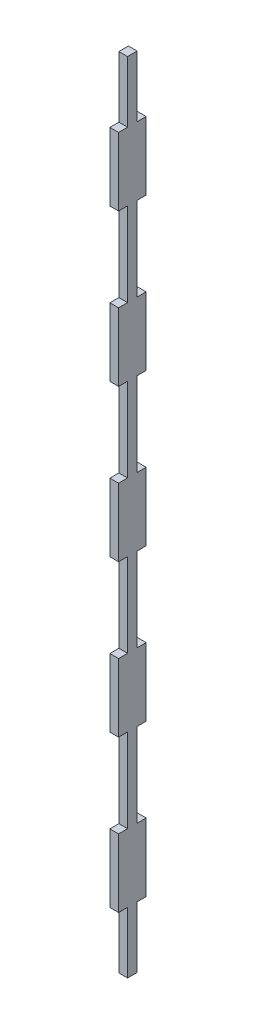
ISO-10303-21;
HEADER;
FILE_DESCRIPTION(('STEP AP214'),'2;1');
FILE_NAME('part.step','',(''),(''),'','','');
FILE_SCHEMA(('AUTOMOTIVE_DESIGN { 1 0 10303 214 1 1 1 1 }'));
ENDSEC;
DATA;
#1=APPLICATION_CONTEXT('core data for automotive mechanical design processes');
#2=APPLICATION_PROTOCOL_DEFINITION('international standard','automotive_design',2000,#1);
#3=PRODUCT_CONTEXT('',#1,'mechanical');
#4=PRODUCT('Part','Part','',(#3));
#5=PRODUCT_RELATED_PRODUCT_CATEGORY('part','',(#4));
#6=PRODUCT_DEFINITION_FORMATION('','',#4);
#7=PRODUCT_DEFINITION_CONTEXT('part definition',#1,'design');
#8=PRODUCT_DEFINITION('design','',#6,#7);
#9=PRODUCT_DEFINITION_SHAPE('','',#8);
#10=(LENGTH_UNIT() NAMED_UNIT(*) SI_UNIT(.MILLI.,.METRE.));
#11=(NAMED_UNIT(*) PLANE_ANGLE_UNIT() SI_UNIT($,.RADIAN.));
#12=(NAMED_UNIT(*) SI_UNIT($,.STERADIAN.) SOLID_ANGLE_UNIT());
#13=UNCERTAINTY_MEASURE_WITH_UNIT(LENGTH_MEASURE(1.E-05),#10,'distance_accuracy_value','');
#14=(GEOMETRIC_REPRESENTATION_CONTEXT(3) GLOBAL_UNCERTAINTY_ASSIGNED_CONTEXT((#13)) GLOBAL_UNIT_ASSIGNED_CONTEXT((#10,
#11,#12)) REPRESENTATION_CONTEXT('',''));
#15=CARTESIAN_POINT('',(0.,0.,0.));
#16=DIRECTION('',(0.,0.,1.));
#17=DIRECTION('',(1.,0.,0.));
#18=AXIS2_PLACEMENT_3D('',#15,#16,#17);
#19=CARTESIAN_POINT('',(-126.400000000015,-108.6,0.));
#20=DIRECTION('',(0.,0.,-1.));
#21=DIRECTION('',(0.,1.,0.));
#22=AXIS2_PLACEMENT_3D('',#19,#20,#21);
#23=PLANE('',#22);
#24=DIRECTION('',(1.38777878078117E-13,1.,0.));
#25=VECTOR('',#24,1.);
#26=CARTESIAN_POINT('',(-123.500000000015,-108.6,0.));
#27=LINE('',#26,#25);
#28=CARTESIAN_POINT('',(-123.500000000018,-129.000000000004,0.));
#29=VERTEX_POINT('',#28);
#30=CARTESIAN_POINT('',(-123.500000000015,-108.6,0.));
#31=VERTEX_POINT('',#30);
#32=EDGE_CURVE('E345',#29,#31,#27,.T.);
#33=ORIENTED_EDGE('',*,*,#32,.T.);
#34=DIRECTION('',(1.,-1.38777878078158E-13,0.));
#35=VECTOR('',#34,1.);
#36=CARTESIAN_POINT('',(-126.400000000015,-108.6,0.));
#37=LINE('',#36,#35);
#38=CARTESIAN_POINT('',(-126.400000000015,-108.6,0.));
#39=VERTEX_POINT('',#38);
#40=EDGE_CURVE('E11',#39,#31,#37,.T.);
#41=ORIENTED_EDGE('',*,*,#40,.F.);
#42=DIRECTION('',(1.38777878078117E-13,1.,0.));
#43=VECTOR('',#42,1.);
#44=CARTESIAN_POINT('',(-126.400000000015,-108.6,0.));
#45=LINE('',#44,#43);
#46=CARTESIAN_POINT('',(-126.400000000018,-129.000000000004,0.));
#47=VERTEX_POINT('',#46);
#48=EDGE_CURVE('E431',#47,#39,#45,.T.);
#49=ORIENTED_EDGE('',*,*,#48,.F.);
#50=DIRECTION('',(1.,-1.38777878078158E-13,0.));
#51=VECTOR('',#50,1.);
#52=CARTESIAN_POINT('',(-126.400000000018,-129.000000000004,0.));
#53=LINE('',#52,#51);
#54=EDGE_CURVE('E341',#47,#29,#53,.T.);
#55=ORIENTED_EDGE('',*,*,#54,.T.);
#56=EDGE_LOOP('',(#33,#41,#49,#55));
#57=FACE_BOUND('',#56,.T.);
#58=ADVANCED_FACE('F33',(#57),#23,.F.);
#59=CARTESIAN_POINT('',(-126.400000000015,-108.6,0.));
#60=DIRECTION('',(1.38777878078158E-13,1.,0.));
#61=DIRECTION('',(-1.,1.38777878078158E-13,0.));
#62=AXIS2_PLACEMENT_3D('',#59,#60,#61);
#63=PLANE('',#62);
#64=DIRECTION('',(0.,0.,1.));
#65=VECTOR('',#64,1.);
#66=CARTESIAN_POINT('',(-123.500000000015,-108.6,0.));
#67=LINE('',#66,#65);
#68=CARTESIAN_POINT('',(-123.500000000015,-108.6,3.));
#69=VERTEX_POINT('',#68);
#70=EDGE_CURVE('E348',#31,#69,#67,.T.);
#71=ORIENTED_EDGE('',*,*,#70,.T.);
#72=DIRECTION('',(1.,-1.38777878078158E-13,0.));
#73=VECTOR('',#72,1.);
#74=CARTESIAN_POINT('',(-126.400000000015,-108.6,3.));
#75=LINE('',#74,#73);
#76=CARTESIAN_POINT('',(-126.400000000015,-108.6,3.));
#77=VERTEX_POINT('',#76);
#78=EDGE_CURVE('E41',#77,#69,#75,.T.);
#79=ORIENTED_EDGE('',*,*,#78,.F.);
#80=DIRECTION('',(0.,0.,1.));
#81=VECTOR('',#80,1.);
#82=CARTESIAN_POINT('',(-126.400000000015,-108.6,0.));
#83=LINE('',#82,#81);
#84=EDGE_CURVE('E200',#39,#77,#83,.T.);
#85=ORIENTED_EDGE('',*,*,#84,.F.);
#86=ORIENTED_EDGE('',*,*,#40,.T.);
#87=EDGE_LOOP('',(#71,#79,#85,#86));
#88=FACE_BOUND('',#87,.T.);
#89=ADVANCED_FACE('F669',(#88),#63,.F.);
#90=CARTESIAN_POINT('',(-126.400000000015,-108.6,3.));
#91=DIRECTION('',(0.,0.,-1.));
#92=DIRECTION('',(0.,1.,0.));
#93=AXIS2_PLACEMENT_3D('',#90,#91,#92);
#94=PLANE('',#93);
#95=DIRECTION('',(1.38777878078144E-13,1.,0.));
#96=VECTOR('',#95,1.);
#97=CARTESIAN_POINT('',(-123.500000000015,-108.6,3.));
#98=LINE('',#97,#96);
#99=CARTESIAN_POINT('',(-123.500000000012,-85.9000000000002,2.99999999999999));
#100=VERTEX_POINT('',#99);
#101=EDGE_CURVE('E350',#69,#100,#98,.T.);
#102=ORIENTED_EDGE('',*,*,#101,.T.);
#103=DIRECTION('',(1.,-1.38777878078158E-13,0.));
#104=VECTOR('',#103,1.);
#105=CARTESIAN_POINT('',(-126.400000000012,-85.8999999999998,2.99999999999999));
#106=LINE('',#105,#104);
#107=CARTESIAN_POINT('',(-126.400000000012,-85.8999999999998,2.99999999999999));
#108=VERTEX_POINT('',#107);
#109=EDGE_CURVE('E546',#108,#100,#106,.T.);
#110=ORIENTED_EDGE('',*,*,#109,.F.);
#111=DIRECTION('',(1.38777878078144E-13,1.,0.));
#112=VECTOR('',#111,1.);
#113=CARTESIAN_POINT('',(-126.400000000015,-108.6,3.));
#114=LINE('',#113,#112);
#115=EDGE_CURVE('E554',#77,#108,#114,.T.);
#116=ORIENTED_EDGE('',*,*,#115,.F.);
#117=ORIENTED_EDGE('',*,*,#78,.T.);
#118=EDGE_LOOP('',(#102,#110,#116,#117));
#119=FACE_BOUND('',#118,.T.);
#120=ADVANCED_FACE('F552',(#119),#94,.F.);
#121=CARTESIAN_POINT('',(-126.400000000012,-85.8999999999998,2.99999999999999));
#122=DIRECTION('',(-1.38777878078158E-13,-1.,0.));
#123=DIRECTION('',(1.,-1.38777878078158E-13,0.));
#124=AXIS2_PLACEMENT_3D('',#121,#122,#123);
#125=PLANE('',#124);
#126=DIRECTION('',(0.,0.,-1.));
#127=VECTOR('',#126,1.);
#128=CARTESIAN_POINT('',(-123.500000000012,-85.9000000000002,2.99999999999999));
#129=LINE('',#128,#127);
#130=CARTESIAN_POINT('',(-123.500000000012,-85.9000000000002,0.));
#131=VERTEX_POINT('',#130);
#132=EDGE_CURVE('E352',#100,#131,#129,.T.);
#133=ORIENTED_EDGE('',*,*,#132,.T.);
#134=DIRECTION('',(1.,-1.38777878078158E-13,0.));
#135=VECTOR('',#134,1.);
#136=CARTESIAN_POINT('',(-126.400000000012,-85.8999999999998,0.));
#137=LINE('',#136,#135);
#138=CARTESIAN_POINT('',(-126.400000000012,-85.8999999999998,0.));
#139=VERTEX_POINT('',#138);
#140=EDGE_CURVE('E543',#139,#131,#137,.T.);
#141=ORIENTED_EDGE('',*,*,#140,.F.);
#142=DIRECTION('',(0.,0.,-1.));
#143=VECTOR('',#142,1.);
#144=CARTESIAN_POINT('',(-126.400000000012,-85.8999999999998,2.99999999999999));
#145=LINE('',#144,#143);
#146=EDGE_CURVE('E572',#108,#139,#145,.T.);
#147=ORIENTED_EDGE('',*,*,#146,.F.);
#148=ORIENTED_EDGE('',*,*,#109,.T.);
#149=EDGE_LOOP('',(#133,#141,#147,#148));
#150=FACE_BOUND('',#149,.T.);
#151=ADVANCED_FACE('F563',(#150),#125,.F.);
#152=CARTESIAN_POINT('',(-126.400000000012,-85.8999999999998,0.));
#153=DIRECTION('',(0.,0.,-1.));
#154=DIRECTION('',(0.,1.,0.));
#155=AXIS2_PLACEMENT_3D('',#152,#153,#154);
#156=PLANE('',#155);
#157=DIRECTION('',(1.38653636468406E-13,1.,0.));
#158=VECTOR('',#157,1.);
#159=CARTESIAN_POINT('',(-123.500000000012,-85.9000000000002,0.));
#160=LINE('',#159,#158);
#161=CARTESIAN_POINT('',(-123.500000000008,-57.9750000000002,0.));
#162=VERTEX_POINT('',#161);
#163=EDGE_CURVE('E354',#131,#162,#160,.T.);
#164=ORIENTED_EDGE('',*,*,#163,.T.);
#165=DIRECTION('',(1.,-1.38777878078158E-13,0.));
#166=VECTOR('',#165,1.);
#167=CARTESIAN_POINT('',(-126.400000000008,-57.9749999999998,0.));
#168=LINE('',#167,#166);
#169=CARTESIAN_POINT('',(-126.400000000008,-57.9749999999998,0.));
#170=VERTEX_POINT('',#169);
#171=EDGE_CURVE('E540',#170,#162,#168,.T.);
#172=ORIENTED_EDGE('',*,*,#171,.F.);
#173=DIRECTION('',(1.38653636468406E-13,1.,0.));
#174=VECTOR('',#173,1.);
#175=CARTESIAN_POINT('',(-126.400000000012,-85.8999999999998,0.));
#176=LINE('',#175,#174);
#177=EDGE_CURVE('E569',#139,#170,#176,.T.);
#178=ORIENTED_EDGE('',*,*,#177,.F.);
#179=ORIENTED_EDGE('',*,*,#140,.T.);
#180=EDGE_LOOP('',(#164,#172,#178,#179));
#181=FACE_BOUND('',#180,.T.);
#182=ADVANCED_FACE('F567',(#181),#156,.F.);
#183=CARTESIAN_POINT('',(-126.400000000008,-57.9749999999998,0.));
#184=DIRECTION('',(1.38777878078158E-13,1.,0.));
#185=DIRECTION('',(-1.,1.38777878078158E-13,0.));
#186=AXIS2_PLACEMENT_3D('',#183,#184,#185);
#187=PLANE('',#186);
#188=DIRECTION('',(0.,0.,1.));
#189=VECTOR('',#188,1.);
#190=CARTESIAN_POINT('',(-123.500000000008,-57.9750000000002,0.));
#191=LINE('',#190,#189);
#192=CARTESIAN_POINT('',(-123.500000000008,-57.9750000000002,2.99999999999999));
#193=VERTEX_POINT('',#192);
#194=EDGE_CURVE('E356',#162,#193,#191,.T.);
#195=ORIENTED_EDGE('',*,*,#194,.T.);
#196=DIRECTION('',(1.,-1.38777878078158E-13,0.));
#197=VECTOR('',#196,1.);
#198=CARTESIAN_POINT('',(-126.400000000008,-57.9749999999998,2.99999999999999));
#199=LINE('',#198,#197);
#200=CARTESIAN_POINT('',(-126.400000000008,-57.9749999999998,2.99999999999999));
#201=VERTEX_POINT('',#200);
#202=EDGE_CURVE('E537',#201,#193,#199,.T.);
#203=ORIENTED_EDGE('',*,*,#202,.F.);
#204=DIRECTION('',(0.,0.,1.));
#205=VECTOR('',#204,1.);
#206=CARTESIAN_POINT('',(-126.400000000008,-57.9749999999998,0.));
#207=LINE('',#206,#205);
#208=EDGE_CURVE('E571',#170,#201,#207,.T.);
#209=ORIENTED_EDGE('',*,*,#208,.F.);
#210=ORIENTED_EDGE('',*,*,#171,.T.);
#211=EDGE_LOOP('',(#195,#203,#209,#210));
#212=FACE_BOUND('',#211,.T.);
#213=ADVANCED_FACE('F682',(#212),#187,.F.);
#214=CARTESIAN_POINT('',(-126.400000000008,-57.9749999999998,2.99999999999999));
#215=DIRECTION('',(0.,0.,-1.));
#216=DIRECTION('',(0.,1.,0.));
#217=AXIS2_PLACEMENT_3D('',#214,#215,#216);
#218=PLANE('',#217);
#219=DIRECTION('',(1.38777878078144E-13,1.,0.));
#220=VECTOR('',#219,1.);
#221=CARTESIAN_POINT('',(-123.500000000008,-57.9750000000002,2.99999999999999));
#222=LINE('',#221,#220);
#223=CARTESIAN_POINT('',(-123.500000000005,-35.2750000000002,2.99999999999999));
#224=VERTEX_POINT('',#223);
#225=EDGE_CURVE('E358',#193,#224,#222,.T.);
#226=ORIENTED_EDGE('',*,*,#225,.T.);
#227=DIRECTION('',(1.,-1.38777878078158E-13,0.));
#228=VECTOR('',#227,1.);
#229=CARTESIAN_POINT('',(-126.400000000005,-35.2749999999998,2.99999999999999));
#230=LINE('',#229,#228);
#231=CARTESIAN_POINT('',(-126.400000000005,-35.2749999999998,2.99999999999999));
#232=VERTEX_POINT('',#231);
#233=EDGE_CURVE('E534',#232,#224,#230,.T.);
#234=ORIENTED_EDGE('',*,*,#233,.F.);
#235=DIRECTION('',(1.38777878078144E-13,1.,0.));
#236=VECTOR('',#235,1.);
#237=CARTESIAN_POINT('',(-126.400000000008,-57.9749999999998,2.99999999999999));
#238=LINE('',#237,#236);
#239=EDGE_CURVE('E574',#201,#232,#238,.T.);
#240=ORIENTED_EDGE('',*,*,#239,.F.);
#241=ORIENTED_EDGE('',*,*,#202,.T.);
#242=EDGE_LOOP('',(#226,#234,#240,#241));
#243=FACE_BOUND('',#242,.T.);
#244=ADVANCED_FACE('F685',(#243),#218,.F.);
#245=CARTESIAN_POINT('',(-126.400000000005,-35.2749999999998,2.99999999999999));
#246=DIRECTION('',(-1.38777878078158E-13,-1.,0.));
#247=DIRECTION('',(1.,-1.38777878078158E-13,0.));
#248=AXIS2_PLACEMENT_3D('',#245,#246,#247);
#249=PLANE('',#248);
#250=DIRECTION('',(0.,0.,-1.));
#251=VECTOR('',#250,1.);
#252=CARTESIAN_POINT('',(-123.500000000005,-35.2750000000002,2.99999999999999));
#253=LINE('',#252,#251);
#254=CARTESIAN_POINT('',(-123.500000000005,-35.2750000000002,0.));
#255=VERTEX_POINT('',#254);
#256=EDGE_CURVE('E360',#224,#255,#253,.T.);
#257=ORIENTED_EDGE('',*,*,#256,.T.);
#258=DIRECTION('',(1.,-1.38777878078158E-13,0.));
#259=VECTOR('',#258,1.);
#260=CARTESIAN_POINT('',(-126.400000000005,-35.2749999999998,0.));
#261=LINE('',#260,#259);
#262=CARTESIAN_POINT('',(-126.400000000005,-35.2749999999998,0.));
#263=VERTEX_POINT('',#262);
#264=EDGE_CURVE('E531',#263,#255,#261,.T.);
#265=ORIENTED_EDGE('',*,*,#264,.F.);
#266=DIRECTION('',(0.,0.,-1.));
#267=VECTOR('',#266,1.);
#268=CARTESIAN_POINT('',(-126.400000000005,-35.2749999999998,2.99999999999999));
#269=LINE('',#268,#267);
#270=EDGE_CURVE('E580',#232,#263,#269,.T.);
#271=ORIENTED_EDGE('',*,*,#270,.F.);
#272=ORIENTED_EDGE('',*,*,#233,.T.);
#273=EDGE_LOOP('',(#257,#265,#271,#272));
#274=FACE_BOUND('',#273,.T.);
#275=ADVANCED_FACE('F689',(#274),#249,.F.);
#276=CARTESIAN_POINT('',(-126.400000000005,-35.2749999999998,0.));
#277=DIRECTION('',(0.,0.,-1.));
#278=DIRECTION('',(0.,1.,0.));
#279=AXIS2_PLACEMENT_3D('',#276,#277,#278);
#280=PLANE('',#279);
#281=DIRECTION('',(1.38653636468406E-13,1.,0.));
#282=VECTOR('',#281,1.);
#283=CARTESIAN_POINT('',(-123.500000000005,-35.2750000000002,0.));
#284=LINE('',#283,#282);
#285=CARTESIAN_POINT('',(-123.500000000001,-7.35000000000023,0.));
#286=VERTEX_POINT('',#285);
#287=EDGE_CURVE('E362',#255,#286,#284,.T.);
#288=ORIENTED_EDGE('',*,*,#287,.T.);
#289=DIRECTION('',(1.,-1.38777878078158E-13,0.));
#290=VECTOR('',#289,1.);
#291=CARTESIAN_POINT('',(-126.400000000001,-7.34999999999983,0.));
#292=LINE('',#291,#290);
#293=CARTESIAN_POINT('',(-126.400000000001,-7.34999999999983,0.));
#294=VERTEX_POINT('',#293);
#295=EDGE_CURVE('E528',#294,#286,#292,.T.);
#296=ORIENTED_EDGE('',*,*,#295,.F.);
#297=DIRECTION('',(1.38653636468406E-13,1.,0.));
#298=VECTOR('',#297,1.);
#299=CARTESIAN_POINT('',(-126.400000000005,-35.2749999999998,0.));
#300=LINE('',#299,#298);
#301=EDGE_CURVE('E582',#263,#294,#300,.T.);
#302=ORIENTED_EDGE('',*,*,#301,.F.);
#303=ORIENTED_EDGE('',*,*,#264,.T.);
#304=EDGE_LOOP('',(#288,#296,#302,#303));
#305=FACE_BOUND('',#304,.T.);
#306=ADVANCED_FACE('F693',(#305),#280,.F.);
#307=CARTESIAN_POINT('',(-126.400000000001,-7.34999999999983,0.));
#308=DIRECTION('',(1.38777878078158E-13,1.,0.));
#309=DIRECTION('',(-1.,1.38777878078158E-13,0.));
#310=AXIS2_PLACEMENT_3D('',#307,#308,#309);
#311=PLANE('',#310);
#312=DIRECTION('',(0.,0.,1.));
#313=VECTOR('',#312,1.);
#314=CARTESIAN_POINT('',(-123.500000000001,-7.35000000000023,0.));
#315=LINE('',#314,#313);
#316=CARTESIAN_POINT('',(-123.500000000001,-7.35000000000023,2.99999999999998));
#317=VERTEX_POINT('',#316);
#318=EDGE_CURVE('E364',#286,#317,#315,.T.);
#319=ORIENTED_EDGE('',*,*,#318,.T.);
#320=DIRECTION('',(1.,-1.38777878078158E-13,0.));
#321=VECTOR('',#320,1.);
#322=CARTESIAN_POINT('',(-126.400000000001,-7.34999999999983,2.99999999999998));
#323=LINE('',#322,#321);
#324=CARTESIAN_POINT('',(-126.400000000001,-7.34999999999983,2.99999999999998));
#325=VERTEX_POINT('',#324);
#326=EDGE_CURVE('E525',#325,#317,#323,.T.);
#327=ORIENTED_EDGE('',*,*,#326,.F.);
#328=DIRECTION('',(0.,0.,1.));
#329=VECTOR('',#328,1.);
#330=CARTESIAN_POINT('',(-126.400000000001,-7.34999999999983,0.));
#331=LINE('',#330,#329);
#332=EDGE_CURVE('E584',#294,#325,#331,.T.);
#333=ORIENTED_EDGE('',*,*,#332,.F.);
#334=ORIENTED_EDGE('',*,*,#295,.T.);
#335=EDGE_LOOP('',(#319,#327,#333,#334));
#336=FACE_BOUND('',#335,.T.);
#337=ADVANCED_FACE('F697',(#336),#311,.F.);
#338=CARTESIAN_POINT('',(-126.400000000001,-7.34999999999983,2.99999999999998));
#339=DIRECTION('',(0.,0.,-1.));
#340=DIRECTION('',(0.,1.,0.));
#341=AXIS2_PLACEMENT_3D('',#338,#339,#340);
#342=PLANE('',#341);
#343=DIRECTION('',(1.39389234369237E-13,1.,0.));
#344=VECTOR('',#343,1.);
#345=CARTESIAN_POINT('',(-123.500000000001,-7.35000000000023,2.99999999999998));
#346=LINE('',#345,#344);
#347=CARTESIAN_POINT('',(-123.499999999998,15.3499999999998,2.99999999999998));
#348=VERTEX_POINT('',#347);
#349=EDGE_CURVE('E366',#317,#348,#346,.T.);
#350=ORIENTED_EDGE('',*,*,#349,.T.);
#351=DIRECTION('',(1.,-1.38777878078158E-13,0.));
#352=VECTOR('',#351,1.);
#353=CARTESIAN_POINT('',(-126.399999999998,15.3500000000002,2.99999999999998));
#354=LINE('',#353,#352);
#355=CARTESIAN_POINT('',(-126.399999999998,15.3500000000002,2.99999999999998));
#356=VERTEX_POINT('',#355);
#357=EDGE_CURVE('E522',#356,#348,#354,.T.);
#358=ORIENTED_EDGE('',*,*,#357,.F.);
#359=DIRECTION('',(1.39389234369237E-13,1.,0.));
#360=VECTOR('',#359,1.);
#361=CARTESIAN_POINT('',(-126.400000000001,-7.34999999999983,2.99999999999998));
#362=LINE('',#361,#360);
#363=EDGE_CURVE('E586',#325,#356,#362,.T.);
#364=ORIENTED_EDGE('',*,*,#363,.F.);
#365=ORIENTED_EDGE('',*,*,#326,.T.);
#366=EDGE_LOOP('',(#350,#358,#364,#365));
#367=FACE_BOUND('',#366,.T.);
#368=ADVANCED_FACE('F701',(#367),#342,.F.);
#369=CARTESIAN_POINT('',(-126.399999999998,15.3500000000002,2.99999999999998));
#370=DIRECTION('',(-1.38777878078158E-13,-1.,0.));
#371=DIRECTION('',(1.,-1.38777878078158E-13,0.));
#372=AXIS2_PLACEMENT_3D('',#369,#370,#371);
#373=PLANE('',#372);
#374=DIRECTION('',(0.,0.,-1.));
#375=VECTOR('',#374,1.);
#376=CARTESIAN_POINT('',(-123.499999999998,15.3499999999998,2.99999999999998));
#377=LINE('',#376,#375);
#378=CARTESIAN_POINT('',(-123.499999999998,15.3499999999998,0.));
#379=VERTEX_POINT('',#378);
#380=EDGE_CURVE('E368',#348,#379,#377,.T.);
#381=ORIENTED_EDGE('',*,*,#380,.T.);
#382=DIRECTION('',(1.,-1.38777878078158E-13,0.));
#383=VECTOR('',#382,1.);
#384=CARTESIAN_POINT('',(-126.399999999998,15.3500000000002,0.));
#385=LINE('',#384,#383);
#386=CARTESIAN_POINT('',(-126.399999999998,15.3500000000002,0.));
#387=VERTEX_POINT('',#386);
#388=EDGE_CURVE('E519',#387,#379,#385,.T.);
#389=ORIENTED_EDGE('',*,*,#388,.F.);
#390=DIRECTION('',(0.,0.,-1.));
#391=VECTOR('',#390,1.);
#392=CARTESIAN_POINT('',(-126.399999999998,15.3500000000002,2.99999999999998));
#393=LINE('',#392,#391);
#394=EDGE_CURVE('E588',#356,#387,#393,.T.);
#395=ORIENTED_EDGE('',*,*,#394,.F.);
#396=ORIENTED_EDGE('',*,*,#357,.T.);
#397=EDGE_LOOP('',(#381,#389,#395,#396));
#398=FACE_BOUND('',#397,.T.);
#399=ADVANCED_FACE('F705',(#398),#373,.F.);
#400=CARTESIAN_POINT('',(-126.399999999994,43.2750000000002,0.));
#401=DIRECTION('',(0.,0.,-1.));
#402=DIRECTION('',(0.,1.,0.));
#403=AXIS2_PLACEMENT_3D('',#400,#401,#402);
#404=PLANE('',#403);
#405=DIRECTION('',(1.38653636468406E-13,1.,0.));
#406=VECTOR('',#405,1.);
#407=CARTESIAN_POINT('',(-123.499999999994,43.2749999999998,0.));
#408=LINE('',#407,#406);
#409=CARTESIAN_POINT('',(-123.499999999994,43.2749999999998,0.));
#410=VERTEX_POINT('',#409);
#411=EDGE_CURVE('E370',#379,#410,#408,.T.);
#412=ORIENTED_EDGE('',*,*,#411,.T.);
#413=DIRECTION('',(1.,-1.38777878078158E-13,0.));
#414=VECTOR('',#413,1.);
#415=CARTESIAN_POINT('',(-126.399999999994,43.2750000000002,0.));
#416=LINE('',#415,#414);
#417=CARTESIAN_POINT('',(-126.399999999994,43.2750000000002,0.));
#418=VERTEX_POINT('',#417);
#419=EDGE_CURVE('E516',#418,#410,#416,.T.);
#420=ORIENTED_EDGE('',*,*,#419,.F.);
#421=DIRECTION('',(1.38653636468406E-13,1.,0.));
#422=VECTOR('',#421,1.);
#423=CARTESIAN_POINT('',(-126.399999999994,43.2750000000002,0.));
#424=LINE('',#423,#422);
#425=EDGE_CURVE('E590',#387,#418,#424,.T.);
#426=ORIENTED_EDGE('',*,*,#425,.F.);
#427=ORIENTED_EDGE('',*,*,#388,.T.);
#428=EDGE_LOOP('',(#412,#420,#426,#427));
#429=FACE_BOUND('',#428,.T.);
#430=ADVANCED_FACE('F709',(#429),#404,.F.);
#431=CARTESIAN_POINT('',(-126.399999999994,43.2750000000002,0.));
#432=DIRECTION('',(1.38777878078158E-13,1.,0.));
#433=DIRECTION('',(-1.,1.38777878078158E-13,0.));
#434=AXIS2_PLACEMENT_3D('',#431,#432,#433);
#435=PLANE('',#434);
#436=DIRECTION('',(0.,0.,1.));
#437=VECTOR('',#436,1.);
#438=CARTESIAN_POINT('',(-123.499999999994,43.2749999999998,0.));
#439=LINE('',#438,#437);
#440=CARTESIAN_POINT('',(-123.499999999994,43.2749999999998,2.99999999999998));
#441=VERTEX_POINT('',#440);
#442=EDGE_CURVE('E372',#410,#441,#439,.T.);
#443=ORIENTED_EDGE('',*,*,#442,.T.);
#444=DIRECTION('',(1.,-1.38777878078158E-13,0.));
#445=VECTOR('',#444,1.);
#446=CARTESIAN_POINT('',(-126.399999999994,43.2750000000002,2.99999999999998));
#447=LINE('',#446,#445);
#448=CARTESIAN_POINT('',(-126.399999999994,43.2750000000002,2.99999999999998));
#449=VERTEX_POINT('',#448);
#450=EDGE_CURVE('E513',#449,#441,#447,.T.);
#451=ORIENTED_EDGE('',*,*,#450,.F.);
#452=DIRECTION('',(0.,0.,1.));
#453=VECTOR('',#452,1.);
#454=CARTESIAN_POINT('',(-126.399999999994,43.2750000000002,0.));
#455=LINE('',#454,#453);
#456=EDGE_CURVE('E592',#418,#449,#455,.T.);
#457=ORIENTED_EDGE('',*,*,#456,.F.);
#458=ORIENTED_EDGE('',*,*,#419,.T.);
#459=EDGE_LOOP('',(#443,#451,#457,#458));
#460=FACE_BOUND('',#459,.T.);
#461=ADVANCED_FACE('F713',(#460),#435,.F.);
#462=CARTESIAN_POINT('',(-126.399999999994,43.2750000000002,2.99999999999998));
#463=DIRECTION('',(0.,0.,-1.));
#464=DIRECTION('',(0.,1.,0.));
#465=AXIS2_PLACEMENT_3D('',#462,#463,#464);
#466=PLANE('',#465);
#467=DIRECTION('',(1.38777878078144E-13,1.,0.));
#468=VECTOR('',#467,1.);
#469=CARTESIAN_POINT('',(-123.499999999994,43.2749999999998,2.99999999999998));
#470=LINE('',#469,#468);
#471=CARTESIAN_POINT('',(-123.499999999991,65.9749999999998,2.99999999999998));
#472=VERTEX_POINT('',#471);
#473=EDGE_CURVE('E374',#441,#472,#470,.T.);
#474=ORIENTED_EDGE('',*,*,#473,.T.);
#475=DIRECTION('',(1.,-1.38777878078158E-13,0.));
#476=VECTOR('',#475,1.);
#477=CARTESIAN_POINT('',(-126.399999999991,65.9750000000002,2.99999999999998));
#478=LINE('',#477,#476);
#479=CARTESIAN_POINT('',(-126.399999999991,65.9750000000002,2.99999999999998));
#480=VERTEX_POINT('',#479);
#481=EDGE_CURVE('E510',#480,#472,#478,.T.);
#482=ORIENTED_EDGE('',*,*,#481,.F.);
#483=DIRECTION('',(1.38777878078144E-13,1.,0.));
#484=VECTOR('',#483,1.);
#485=CARTESIAN_POINT('',(-126.399999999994,43.2750000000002,2.99999999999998));
#486=LINE('',#485,#484);
#487=EDGE_CURVE('E594',#449,#480,#486,.T.);
#488=ORIENTED_EDGE('',*,*,#487,.F.);
#489=ORIENTED_EDGE('',*,*,#450,.T.);
#490=EDGE_LOOP('',(#474,#482,#488,#489));
#491=FACE_BOUND('',#490,.T.);
#492=ADVANCED_FACE('F717',(#491),#466,.F.);
#493=CARTESIAN_POINT('',(-126.399999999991,65.9750000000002,2.99999999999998));
#494=DIRECTION('',(-1.38777878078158E-13,-1.,0.));
#495=DIRECTION('',(1.,-1.38777878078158E-13,0.));
#496=AXIS2_PLACEMENT_3D('',#493,#494,#495);
#497=PLANE('',#496);
#498=DIRECTION('',(0.,0.,-1.));
#499=VECTOR('',#498,1.);
#500=CARTESIAN_POINT('',(-123.499999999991,65.9749999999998,2.99999999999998));
#501=LINE('',#500,#499);
#502=CARTESIAN_POINT('',(-123.499999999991,65.9749999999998,0.));
#503=VERTEX_POINT('',#502);
#504=EDGE_CURVE('E376',#472,#503,#501,.T.);
#505=ORIENTED_EDGE('',*,*,#504,.T.);
#506=DIRECTION('',(1.,-1.38777878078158E-13,0.));
#507=VECTOR('',#506,1.);
#508=CARTESIAN_POINT('',(-126.399999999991,65.9750000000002,0.));
#509=LINE('',#508,#507);
#510=CARTESIAN_POINT('',(-126.399999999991,65.9750000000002,0.));
#511=VERTEX_POINT('',#510);
#512=EDGE_CURVE('E507',#511,#503,#509,.T.);
#513=ORIENTED_EDGE('',*,*,#512,.F.);
#514=DIRECTION('',(0.,0.,-1.));
#515=VECTOR('',#514,1.);
#516=CARTESIAN_POINT('',(-126.399999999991,65.9750000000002,2.99999999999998));
#517=LINE('',#516,#515);
#518=EDGE_CURVE('E596',#480,#511,#517,.T.);
#519=ORIENTED_EDGE('',*,*,#518,.F.);
#520=ORIENTED_EDGE('',*,*,#481,.T.);
#521=EDGE_LOOP('',(#505,#513,#519,#520));
#522=FACE_BOUND('',#521,.T.);
#523=ADVANCED_FACE('F721',(#522),#497,.F.);
#524=CARTESIAN_POINT('',(-126.399999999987,93.9000000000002,0.));
#525=DIRECTION('',(0.,0.,-1.));
#526=DIRECTION('',(0.,1.,0.));
#527=AXIS2_PLACEMENT_3D('',#524,#525,#526);
#528=PLANE('',#527);
#529=DIRECTION('',(1.38653636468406E-13,1.,0.));
#530=VECTOR('',#529,1.);
#531=CARTESIAN_POINT('',(-123.499999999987,93.8999999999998,0.));
#532=LINE('',#531,#530);
#533=CARTESIAN_POINT('',(-123.499999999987,93.8999999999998,0.));
#534=VERTEX_POINT('',#533);
#535=EDGE_CURVE('E378',#503,#534,#532,.T.);
#536=ORIENTED_EDGE('',*,*,#535,.T.);
#537=DIRECTION('',(1.,-1.38777878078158E-13,0.));
#538=VECTOR('',#537,1.);
#539=CARTESIAN_POINT('',(-126.399999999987,93.9000000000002,0.));
#540=LINE('',#539,#538);
#541=CARTESIAN_POINT('',(-126.399999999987,93.9000000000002,0.));
#542=VERTEX_POINT('',#541);
#543=EDGE_CURVE('E504',#542,#534,#540,.T.);
#544=ORIENTED_EDGE('',*,*,#543,.F.);
#545=DIRECTION('',(1.38653636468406E-13,1.,0.));
#546=VECTOR('',#545,1.);
#547=CARTESIAN_POINT('',(-126.399999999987,93.9000000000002,0.));
#548=LINE('',#547,#546);
#549=EDGE_CURVE('E598',#511,#542,#548,.T.);
#550=ORIENTED_EDGE('',*,*,#549,.F.);
#551=ORIENTED_EDGE('',*,*,#512,.T.);
#552=EDGE_LOOP('',(#536,#544,#550,#551));
#553=FACE_BOUND('',#552,.T.);
#554=ADVANCED_FACE('F725',(#553),#528,.F.);
#555=CARTESIAN_POINT('',(-126.399999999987,93.9000000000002,0.));
#556=DIRECTION('',(1.38777878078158E-13,1.,0.));
#557=DIRECTION('',(-1.,1.38777878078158E-13,0.));
#558=AXIS2_PLACEMENT_3D('',#555,#556,#557);
#559=PLANE('',#558);
#560=DIRECTION('',(0.,0.,1.));
#561=VECTOR('',#560,1.);
#562=CARTESIAN_POINT('',(-123.499999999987,93.8999999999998,0.));
#563=LINE('',#562,#561);
#564=CARTESIAN_POINT('',(-123.499999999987,93.8999999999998,2.99999999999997));
#565=VERTEX_POINT('',#564);
#566=EDGE_CURVE('E380',#534,#565,#563,.T.);
#567=ORIENTED_EDGE('',*,*,#566,.T.);
#568=DIRECTION('',(1.,-1.38777878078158E-13,0.));
#569=VECTOR('',#568,1.);
#570=CARTESIAN_POINT('',(-126.399999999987,93.9000000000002,2.99999999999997));
#571=LINE('',#570,#569);
#572=CARTESIAN_POINT('',(-126.399999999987,93.9000000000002,2.99999999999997));
#573=VERTEX_POINT('',#572);
#574=EDGE_CURVE('E501',#573,#565,#571,.T.);
#575=ORIENTED_EDGE('',*,*,#574,.F.);
#576=DIRECTION('',(0.,0.,1.));
#577=VECTOR('',#576,1.);
#578=CARTESIAN_POINT('',(-126.399999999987,93.9000000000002,0.));
#579=LINE('',#578,#577);
#580=EDGE_CURVE('E600',#542,#573,#579,.T.);
#581=ORIENTED_EDGE('',*,*,#580,.F.);
#582=ORIENTED_EDGE('',*,*,#543,.T.);
#583=EDGE_LOOP('',(#567,#575,#581,#582));
#584=FACE_BOUND('',#583,.T.);
#585=ADVANCED_FACE('F729',(#584),#559,.F.);
#586=CARTESIAN_POINT('',(-126.399999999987,93.9000000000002,2.99999999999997));
#587=DIRECTION('',(0.,0.,-1.));
#588=DIRECTION('',(0.,1.,0.));
#589=AXIS2_PLACEMENT_3D('',#586,#587,#588);
#590=PLANE('',#589);
#591=DIRECTION('',(1.38777878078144E-13,1.,0.));
#592=VECTOR('',#591,1.);
#593=CARTESIAN_POINT('',(-123.499999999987,93.8999999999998,2.99999999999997));
#594=LINE('',#593,#592);
#595=CARTESIAN_POINT('',(-123.499999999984,116.6,2.99999999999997));
#596=VERTEX_POINT('',#595);
#597=EDGE_CURVE('E382',#565,#596,#594,.T.);
#598=ORIENTED_EDGE('',*,*,#597,.T.);
#599=DIRECTION('',(1.,-1.38777878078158E-13,0.));
#600=VECTOR('',#599,1.);
#601=CARTESIAN_POINT('',(-126.399999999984,116.6,2.99999999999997));
#602=LINE('',#601,#600);
#603=CARTESIAN_POINT('',(-126.399999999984,116.6,2.99999999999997));
#604=VERTEX_POINT('',#603);
#605=EDGE_CURVE('E498',#604,#596,#602,.T.);
#606=ORIENTED_EDGE('',*,*,#605,.F.);
#607=DIRECTION('',(1.38777878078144E-13,1.,0.));
#608=VECTOR('',#607,1.);
#609=CARTESIAN_POINT('',(-126.399999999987,93.9000000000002,2.99999999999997));
#610=LINE('',#609,#608);
#611=EDGE_CURVE('E602',#573,#604,#610,.T.);
#612=ORIENTED_EDGE('',*,*,#611,.F.);
#613=ORIENTED_EDGE('',*,*,#574,.T.);
#614=EDGE_LOOP('',(#598,#606,#612,#613));
#615=FACE_BOUND('',#614,.T.);
#616=ADVANCED_FACE('F733',(#615),#590,.F.);
#617=CARTESIAN_POINT('',(-126.399999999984,116.6,2.99999999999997));
#618=DIRECTION('',(-1.38777878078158E-13,-1.,0.));
#619=DIRECTION('',(1.,-1.38777878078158E-13,0.));
#620=AXIS2_PLACEMENT_3D('',#617,#618,#619);
#621=PLANE('',#620);
#622=DIRECTION('',(0.,0.,-1.));
#623=VECTOR('',#622,1.);
#624=CARTESIAN_POINT('',(-123.499999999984,116.6,2.99999999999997));
#625=LINE('',#624,#623);
#626=CARTESIAN_POINT('',(-123.499999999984,116.6,0.));
#627=VERTEX_POINT('',#626);
#628=EDGE_CURVE('E384',#596,#627,#625,.T.);
#629=ORIENTED_EDGE('',*,*,#628,.T.);
#630=DIRECTION('',(1.,-1.38777878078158E-13,0.));
#631=VECTOR('',#630,1.);
#632=CARTESIAN_POINT('',(-126.399999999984,116.6,0.));
#633=LINE('',#632,#631);
#634=CARTESIAN_POINT('',(-126.399999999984,116.6,0.));
#635=VERTEX_POINT('',#634);
#636=EDGE_CURVE('E495',#635,#627,#633,.T.);
#637=ORIENTED_EDGE('',*,*,#636,.F.);
#638=DIRECTION('',(0.,0.,-1.));
#639=VECTOR('',#638,1.);
#640=CARTESIAN_POINT('',(-126.399999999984,116.6,2.99999999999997));
#641=LINE('',#640,#639);
#642=EDGE_CURVE('E604',#604,#635,#641,.T.);
#643=ORIENTED_EDGE('',*,*,#642,.F.);
#644=ORIENTED_EDGE('',*,*,#605,.T.);
#645=EDGE_LOOP('',(#629,#637,#643,#644));
#646=FACE_BOUND('',#645,.T.);
#647=ADVANCED_FACE('F737',(#646),#621,.F.);
#648=CARTESIAN_POINT('',(-126.399999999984,116.6,0.));
#649=DIRECTION('',(0.,0.,-1.));
#650=DIRECTION('',(0.,1.,0.));
#651=AXIS2_PLACEMENT_3D('',#648,#649,#650);
#652=PLANE('',#651);
#653=DIRECTION('',(1.38777878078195E-13,1.,0.));
#654=VECTOR('',#653,1.);
#655=CARTESIAN_POINT('',(-123.499999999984,116.6,0.));
#656=LINE('',#655,#654);
#657=CARTESIAN_POINT('',(-123.499999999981,136.999999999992,0.));
#658=VERTEX_POINT('',#657);
#659=EDGE_CURVE('E386',#627,#658,#656,.T.);
#660=ORIENTED_EDGE('',*,*,#659,.T.);
#661=DIRECTION('',(1.,-1.38777878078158E-13,0.));
#662=VECTOR('',#661,1.);
#663=CARTESIAN_POINT('',(-126.399999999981,136.999999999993,0.));
#664=LINE('',#663,#662);
#665=CARTESIAN_POINT('',(-126.399999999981,136.999999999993,0.));
#666=VERTEX_POINT('',#665);
#667=EDGE_CURVE('E492',#666,#658,#664,.T.);
#668=ORIENTED_EDGE('',*,*,#667,.F.);
#669=DIRECTION('',(1.38777878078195E-13,1.,0.));
#670=VECTOR('',#669,1.);
#671=CARTESIAN_POINT('',(-126.399999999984,116.6,0.));
#672=LINE('',#671,#670);
#673=EDGE_CURVE('E606',#635,#666,#672,.T.);
#674=ORIENTED_EDGE('',*,*,#673,.F.);
#675=ORIENTED_EDGE('',*,*,#636,.T.);
#676=EDGE_LOOP('',(#660,#668,#674,#675));
#677=FACE_BOUND('',#676,.T.);
#678=ADVANCED_FACE('F741',(#677),#652,.F.);
#679=CARTESIAN_POINT('',(-126.399999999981,136.999999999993,-3.2));
#680=DIRECTION('',(-1.38777878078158E-13,-1.,0.));
#681=DIRECTION('',(1.,-1.38777878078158E-13,0.));
#682=AXIS2_PLACEMENT_3D('',#679,#680,#681);
#683=PLANE('',#682);
#684=DIRECTION('',(0.,0.,-1.));
#685=VECTOR('',#684,1.);
#686=CARTESIAN_POINT('',(-123.499999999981,136.999999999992,-3.2));
#687=LINE('',#686,#685);
#688=CARTESIAN_POINT('',(-123.499999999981,136.999999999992,-3.2));
#689=VERTEX_POINT('',#688);
#690=EDGE_CURVE('E388',#658,#689,#687,.T.);
#691=ORIENTED_EDGE('',*,*,#690,.T.);
#692=DIRECTION('',(1.,-1.38777878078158E-13,0.));
#693=VECTOR('',#692,1.);
#694=CARTESIAN_POINT('',(-126.399999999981,136.999999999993,-3.2));
#695=LINE('',#694,#693);
#696=CARTESIAN_POINT('',(-126.399999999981,136.999999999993,-3.2));
#697=VERTEX_POINT('',#696);
#698=EDGE_CURVE('E489',#697,#689,#695,.T.);
#699=ORIENTED_EDGE('',*,*,#698,.F.);
#700=DIRECTION('',(0.,0.,-1.));
#701=VECTOR('',#700,1.);
#702=CARTESIAN_POINT('',(-126.399999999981,136.999999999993,-3.2));
#703=LINE('',#702,#701);
#704=EDGE_CURVE('E608',#666,#697,#703,.T.);
#705=ORIENTED_EDGE('',*,*,#704,.F.);
#706=ORIENTED_EDGE('',*,*,#667,.T.);
#707=EDGE_LOOP('',(#691,#699,#705,#706));
#708=FACE_BOUND('',#707,.T.);
#709=ADVANCED_FACE('F745',(#708),#683,.F.);
#710=CARTESIAN_POINT('',(-126.399999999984,116.6,-3.2));
#711=DIRECTION('',(0.,0.,1.));
#712=DIRECTION('',(0.,-1.,0.));
#713=AXIS2_PLACEMENT_3D('',#710,#711,#712);
#714=PLANE('',#713);
#715=DIRECTION('',(-1.38777878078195E-13,-1.,0.));
#716=VECTOR('',#715,1.);
#717=CARTESIAN_POINT('',(-123.499999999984,116.6,-3.2));
#718=LINE('',#717,#716);
#719=CARTESIAN_POINT('',(-123.499999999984,116.6,-3.2));
#720=VERTEX_POINT('',#719);
#721=EDGE_CURVE('E390',#689,#720,#718,.T.);
#722=ORIENTED_EDGE('',*,*,#721,.T.);
#723=DIRECTION('',(1.,-1.38777878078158E-13,0.));
#724=VECTOR('',#723,1.);
#725=CARTESIAN_POINT('',(-126.399999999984,116.6,-3.2));
#726=LINE('',#725,#724);
#727=CARTESIAN_POINT('',(-126.399999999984,116.6,-3.2));
#728=VERTEX_POINT('',#727);
#729=EDGE_CURVE('E486',#728,#720,#726,.T.);
#730=ORIENTED_EDGE('',*,*,#729,.F.);
#731=DIRECTION('',(-1.38777878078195E-13,-1.,0.));
#732=VECTOR('',#731,1.);
#733=CARTESIAN_POINT('',(-126.399999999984,116.6,-3.2));
#734=LINE('',#733,#732);
#735=EDGE_CURVE('E610',#697,#728,#734,.T.);
#736=ORIENTED_EDGE('',*,*,#735,.F.);
#737=ORIENTED_EDGE('',*,*,#698,.T.);
#738=EDGE_LOOP('',(#722,#730,#736,#737));
#739=FACE_BOUND('',#738,.T.);
#740=ADVANCED_FACE('F749',(#739),#714,.F.);
#741=CARTESIAN_POINT('',(-126.399999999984,116.6,-6.19999999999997));
#742=DIRECTION('',(-1.38777878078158E-13,-1.,0.));
#743=DIRECTION('',(1.,-1.38777878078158E-13,0.));
#744=AXIS2_PLACEMENT_3D('',#741,#742,#743);
#745=PLANE('',#744);
#746=DIRECTION('',(0.,0.,-1.));
#747=VECTOR('',#746,1.);
#748=CARTESIAN_POINT('',(-123.499999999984,116.6,-6.19999999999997));
#749=LINE('',#748,#747);
#750=CARTESIAN_POINT('',(-123.499999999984,116.6,-6.19999999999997));
#751=VERTEX_POINT('',#750);
#752=EDGE_CURVE('E392',#720,#751,#749,.T.);
#753=ORIENTED_EDGE('',*,*,#752,.T.);
#754=DIRECTION('',(1.,-1.38777878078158E-13,0.));
#755=VECTOR('',#754,1.);
#756=CARTESIAN_POINT('',(-126.399999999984,116.6,-6.19999999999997));
#757=LINE('',#756,#755);
#758=CARTESIAN_POINT('',(-126.399999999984,116.6,-6.19999999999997));
#759=VERTEX_POINT('',#758);
#760=EDGE_CURVE('E483',#759,#751,#757,.T.);
#761=ORIENTED_EDGE('',*,*,#760,.F.);
#762=DIRECTION('',(0.,0.,-1.));
#763=VECTOR('',#762,1.);
#764=CARTESIAN_POINT('',(-126.399999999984,116.6,-6.19999999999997));
#765=LINE('',#764,#763);
#766=EDGE_CURVE('E612',#728,#759,#765,.T.);
#767=ORIENTED_EDGE('',*,*,#766,.F.);
#768=ORIENTED_EDGE('',*,*,#729,.T.);
#769=EDGE_LOOP('',(#753,#761,#767,#768));
#770=FACE_BOUND('',#769,.T.);
#771=ADVANCED_FACE('F753',(#770),#745,.F.);
#772=CARTESIAN_POINT('',(-126.399999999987,93.9000000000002,-6.19999999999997));
#773=DIRECTION('',(0.,0.,1.));
#774=DIRECTION('',(0.,-1.,0.));
#775=AXIS2_PLACEMENT_3D('',#772,#773,#774);
#776=PLANE('',#775);
#777=DIRECTION('',(-1.38777878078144E-13,-1.,0.));
#778=VECTOR('',#777,1.);
#779=CARTESIAN_POINT('',(-123.499999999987,93.8999999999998,-6.19999999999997));
#780=LINE('',#779,#778);
#781=CARTESIAN_POINT('',(-123.499999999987,93.8999999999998,-6.19999999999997));
#782=VERTEX_POINT('',#781);
#783=EDGE_CURVE('E394',#751,#782,#780,.T.);
#784=ORIENTED_EDGE('',*,*,#783,.T.);
#785=DIRECTION('',(1.,-1.38777878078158E-13,0.));
#786=VECTOR('',#785,1.);
#787=CARTESIAN_POINT('',(-126.399999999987,93.9000000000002,-6.19999999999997));
#788=LINE('',#787,#786);
#789=CARTESIAN_POINT('',(-126.399999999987,93.9000000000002,-6.19999999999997));
#790=VERTEX_POINT('',#789);
#791=EDGE_CURVE('E480',#790,#782,#788,.T.);
#792=ORIENTED_EDGE('',*,*,#791,.F.);
#793=DIRECTION('',(-1.38777878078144E-13,-1.,0.));
#794=VECTOR('',#793,1.);
#795=CARTESIAN_POINT('',(-126.399999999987,93.9000000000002,-6.19999999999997));
#796=LINE('',#795,#794);
#797=EDGE_CURVE('E614',#759,#790,#796,.T.);
#798=ORIENTED_EDGE('',*,*,#797,.F.);
#799=ORIENTED_EDGE('',*,*,#760,.T.);
#800=EDGE_LOOP('',(#784,#792,#798,#799));
#801=FACE_BOUND('',#800,.T.);
#802=ADVANCED_FACE('F757',(#801),#776,.F.);
#803=CARTESIAN_POINT('',(-126.399999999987,93.9000000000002,-3.2));
#804=DIRECTION('',(1.38777878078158E-13,1.,0.));
#805=DIRECTION('',(-1.,1.38777878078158E-13,0.));
#806=AXIS2_PLACEMENT_3D('',#803,#804,#805);
#807=PLANE('',#806);
#808=DIRECTION('',(0.,0.,1.));
#809=VECTOR('',#808,1.);
#810=CARTESIAN_POINT('',(-123.499999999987,93.8999999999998,-3.2));
#811=LINE('',#810,#809);
#812=CARTESIAN_POINT('',(-123.499999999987,93.8999999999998,-3.2));
#813=VERTEX_POINT('',#812);
#814=EDGE_CURVE('E396',#782,#813,#811,.T.);
#815=ORIENTED_EDGE('',*,*,#814,.T.);
#816=DIRECTION('',(1.,-1.38777878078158E-13,0.));
#817=VECTOR('',#816,1.);
#818=CARTESIAN_POINT('',(-126.399999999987,93.9000000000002,-3.2));
#819=LINE('',#818,#817);
#820=CARTESIAN_POINT('',(-126.399999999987,93.9000000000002,-3.2));
#821=VERTEX_POINT('',#820);
#822=EDGE_CURVE('E477',#821,#813,#819,.T.);
#823=ORIENTED_EDGE('',*,*,#822,.F.);
#824=DIRECTION('',(0.,0.,1.));
#825=VECTOR('',#824,1.);
#826=CARTESIAN_POINT('',(-126.399999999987,93.9000000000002,-3.2));
#827=LINE('',#826,#825);
#828=EDGE_CURVE('E616',#790,#821,#827,.T.);
#829=ORIENTED_EDGE('',*,*,#828,.F.);
#830=ORIENTED_EDGE('',*,*,#791,.T.);
#831=EDGE_LOOP('',(#815,#823,#829,#830));
#832=FACE_BOUND('',#831,.T.);
#833=ADVANCED_FACE('F761',(#832),#807,.F.);
#834=CARTESIAN_POINT('',(-126.399999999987,93.9000000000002,-3.2));
#835=DIRECTION('',(0.,0.,1.));
#836=DIRECTION('',(1.,0.,0.));
#837=AXIS2_PLACEMENT_3D('',#834,#835,#836);
#838=PLANE('',#837);
#839=DIRECTION('',(-1.38653636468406E-13,-1.,0.));
#840=VECTOR('',#839,1.);
#841=CARTESIAN_POINT('',(-123.499999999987,93.8999999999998,-3.2));
#842=LINE('',#841,#840);
#843=CARTESIAN_POINT('',(-123.499999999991,65.9749999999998,-3.2));
#844=VERTEX_POINT('',#843);
#845=EDGE_CURVE('E398',#813,#844,#842,.T.);
#846=ORIENTED_EDGE('',*,*,#845,.T.);
#847=DIRECTION('',(1.,-1.38777878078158E-13,0.));
#848=VECTOR('',#847,1.);
#849=CARTESIAN_POINT('',(-126.399999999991,65.9750000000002,-3.2));
#850=LINE('',#849,#848);
#851=CARTESIAN_POINT('',(-126.399999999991,65.9750000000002,-3.2));
#852=VERTEX_POINT('',#851);
#853=EDGE_CURVE('E474',#852,#844,#850,.T.);
#854=ORIENTED_EDGE('',*,*,#853,.F.);
#855=DIRECTION('',(-1.38653636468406E-13,-1.,0.));
#856=VECTOR('',#855,1.);
#857=CARTESIAN_POINT('',(-126.399999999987,93.9000000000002,-3.2));
#858=LINE('',#857,#856);
#859=EDGE_CURVE('E618',#821,#852,#858,.T.);
#860=ORIENTED_EDGE('',*,*,#859,.F.);
#861=ORIENTED_EDGE('',*,*,#822,.T.);
#862=EDGE_LOOP('',(#846,#854,#860,#861));
#863=FACE_BOUND('',#862,.T.);
#864=ADVANCED_FACE('F765',(#863),#838,.F.);
#865=CARTESIAN_POINT('',(-126.399999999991,65.9750000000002,-6.19999999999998));
#866=DIRECTION('',(-1.38777878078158E-13,-1.,0.));
#867=DIRECTION('',(1.,-1.38777878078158E-13,0.));
#868=AXIS2_PLACEMENT_3D('',#865,#866,#867);
#869=PLANE('',#868);
#870=DIRECTION('',(0.,0.,-1.));
#871=VECTOR('',#870,1.);
#872=CARTESIAN_POINT('',(-123.499999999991,65.9749999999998,-6.19999999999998));
#873=LINE('',#872,#871);
#874=CARTESIAN_POINT('',(-123.499999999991,65.9749999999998,-6.19999999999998));
#875=VERTEX_POINT('',#874);
#876=EDGE_CURVE('E400',#844,#875,#873,.T.);
#877=ORIENTED_EDGE('',*,*,#876,.T.);
#878=DIRECTION('',(1.,-1.38777878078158E-13,0.));
#879=VECTOR('',#878,1.);
#880=CARTESIAN_POINT('',(-126.399999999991,65.9750000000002,-6.19999999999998));
#881=LINE('',#880,#879);
#882=CARTESIAN_POINT('',(-126.399999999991,65.9750000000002,-6.19999999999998));
#883=VERTEX_POINT('',#882);
#884=EDGE_CURVE('E471',#883,#875,#881,.T.);
#885=ORIENTED_EDGE('',*,*,#884,.F.);
#886=DIRECTION('',(0.,0.,-1.));
#887=VECTOR('',#886,1.);
#888=CARTESIAN_POINT('',(-126.399999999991,65.9750000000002,-6.19999999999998));
#889=LINE('',#888,#887);
#890=EDGE_CURVE('E620',#852,#883,#889,.T.);
#891=ORIENTED_EDGE('',*,*,#890,.F.);
#892=ORIENTED_EDGE('',*,*,#853,.T.);
#893=EDGE_LOOP('',(#877,#885,#891,#892));
#894=FACE_BOUND('',#893,.T.);
#895=ADVANCED_FACE('F769',(#894),#869,.F.);
#896=CARTESIAN_POINT('',(-126.399999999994,43.2750000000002,-6.19999999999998));
#897=DIRECTION('',(0.,0.,1.));
#898=DIRECTION('',(0.,-1.,0.));
#899=AXIS2_PLACEMENT_3D('',#896,#897,#898);
#900=PLANE('',#899);
#901=DIRECTION('',(-1.38777878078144E-13,-1.,0.));
#902=VECTOR('',#901,1.);
#903=CARTESIAN_POINT('',(-123.499999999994,43.2749999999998,-6.19999999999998));
#904=LINE('',#903,#902);
#905=CARTESIAN_POINT('',(-123.499999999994,43.2749999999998,-6.19999999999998));
#906=VERTEX_POINT('',#905);
#907=EDGE_CURVE('E402',#875,#906,#904,.T.);
#908=ORIENTED_EDGE('',*,*,#907,.T.);
#909=DIRECTION('',(1.,-1.38777878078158E-13,0.));
#910=VECTOR('',#909,1.);
#911=CARTESIAN_POINT('',(-126.399999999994,43.2750000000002,-6.19999999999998));
#912=LINE('',#911,#910);
#913=CARTESIAN_POINT('',(-126.399999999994,43.2750000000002,-6.19999999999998));
#914=VERTEX_POINT('',#913);
#915=EDGE_CURVE('E468',#914,#906,#912,.T.);
#916=ORIENTED_EDGE('',*,*,#915,.F.);
#917=DIRECTION('',(-1.38777878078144E-13,-1.,0.));
#918=VECTOR('',#917,1.);
#919=CARTESIAN_POINT('',(-126.399999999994,43.2750000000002,-6.19999999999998));
#920=LINE('',#919,#918);
#921=EDGE_CURVE('E622',#883,#914,#920,.T.);
#922=ORIENTED_EDGE('',*,*,#921,.F.);
#923=ORIENTED_EDGE('',*,*,#884,.T.);
#924=EDGE_LOOP('',(#908,#916,#922,#923));
#925=FACE_BOUND('',#924,.T.);
#926=ADVANCED_FACE('F773',(#925),#900,.F.);
#927=CARTESIAN_POINT('',(-126.399999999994,43.2750000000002,-3.2));
#928=DIRECTION('',(1.38777878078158E-13,1.,0.));
#929=DIRECTION('',(-1.,1.38777878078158E-13,0.));
#930=AXIS2_PLACEMENT_3D('',#927,#928,#929);
#931=PLANE('',#930);
#932=DIRECTION('',(0.,0.,1.));
#933=VECTOR('',#932,1.);
#934=CARTESIAN_POINT('',(-123.499999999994,43.2749999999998,-3.2));
#935=LINE('',#934,#933);
#936=CARTESIAN_POINT('',(-123.499999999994,43.2749999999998,-3.2));
#937=VERTEX_POINT('',#936);
#938=EDGE_CURVE('E404',#906,#937,#935,.T.);
#939=ORIENTED_EDGE('',*,*,#938,.T.);
#940=DIRECTION('',(1.,-1.38777878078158E-13,0.));
#941=VECTOR('',#940,1.);
#942=CARTESIAN_POINT('',(-126.399999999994,43.2750000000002,-3.2));
#943=LINE('',#942,#941);
#944=CARTESIAN_POINT('',(-126.399999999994,43.2750000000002,-3.2));
#945=VERTEX_POINT('',#944);
#946=EDGE_CURVE('E465',#945,#937,#943,.T.);
#947=ORIENTED_EDGE('',*,*,#946,.F.);
#948=DIRECTION('',(0.,0.,1.));
#949=VECTOR('',#948,1.);
#950=CARTESIAN_POINT('',(-126.399999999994,43.2750000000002,-3.2));
#951=LINE('',#950,#949);
#952=EDGE_CURVE('E624',#914,#945,#951,.T.);
#953=ORIENTED_EDGE('',*,*,#952,.F.);
#954=ORIENTED_EDGE('',*,*,#915,.T.);
#955=EDGE_LOOP('',(#939,#947,#953,#954));
#956=FACE_BOUND('',#955,.T.);
#957=ADVANCED_FACE('F777',(#956),#931,.F.);
#958=CARTESIAN_POINT('',(-126.399999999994,43.2750000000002,-3.2));
#959=DIRECTION('',(0.,0.,1.));
#960=DIRECTION('',(1.,0.,0.));
#961=AXIS2_PLACEMENT_3D('',#958,#959,#960);
#962=PLANE('',#961);
#963=DIRECTION('',(-1.38653636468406E-13,-1.,0.));
#964=VECTOR('',#963,1.);
#965=CARTESIAN_POINT('',(-123.499999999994,43.2749999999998,-3.2));
#966=LINE('',#965,#964);
#967=CARTESIAN_POINT('',(-123.499999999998,15.3499999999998,-3.2));
#968=VERTEX_POINT('',#967);
#969=EDGE_CURVE('E406',#937,#968,#966,.T.);
#970=ORIENTED_EDGE('',*,*,#969,.T.);
#971=DIRECTION('',(1.,-1.38777878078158E-13,0.));
#972=VECTOR('',#971,1.);
#973=CARTESIAN_POINT('',(-126.399999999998,15.3500000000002,-3.2));
#974=LINE('',#973,#972);
#975=CARTESIAN_POINT('',(-126.399999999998,15.3500000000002,-3.2));
#976=VERTEX_POINT('',#975);
#977=EDGE_CURVE('E462',#976,#968,#974,.T.);
#978=ORIENTED_EDGE('',*,*,#977,.F.);
#979=DIRECTION('',(-1.38653636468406E-13,-1.,0.));
#980=VECTOR('',#979,1.);
#981=CARTESIAN_POINT('',(-126.399999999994,43.2750000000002,-3.2));
#982=LINE('',#981,#980);
#983=EDGE_CURVE('E626',#945,#976,#982,.T.);
#984=ORIENTED_EDGE('',*,*,#983,.F.);
#985=ORIENTED_EDGE('',*,*,#946,.T.);
#986=EDGE_LOOP('',(#970,#978,#984,#985));
#987=FACE_BOUND('',#986,.T.);
#988=ADVANCED_FACE('F781',(#987),#962,.F.);
#989=CARTESIAN_POINT('',(-126.399999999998,15.3500000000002,-6.19999999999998));
#990=DIRECTION('',(-1.38777878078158E-13,-1.,0.));
#991=DIRECTION('',(1.,-1.38777878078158E-13,0.));
#992=AXIS2_PLACEMENT_3D('',#989,#990,#991);
#993=PLANE('',#992);
#994=DIRECTION('',(0.,0.,-1.));
#995=VECTOR('',#994,1.);
#996=CARTESIAN_POINT('',(-123.499999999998,15.3499999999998,-6.19999999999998));
#997=LINE('',#996,#995);
#998=CARTESIAN_POINT('',(-123.499999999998,15.3499999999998,-6.19999999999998));
#999=VERTEX_POINT('',#998);
#1000=EDGE_CURVE('E408',#968,#999,#997,.T.);
#1001=ORIENTED_EDGE('',*,*,#1000,.T.);
#1002=DIRECTION('',(1.,-1.38777878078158E-13,0.));
#1003=VECTOR('',#1002,1.);
#1004=CARTESIAN_POINT('',(-126.399999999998,15.3500000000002,-6.19999999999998));
#1005=LINE('',#1004,#1003);
#1006=CARTESIAN_POINT('',(-126.399999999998,15.3500000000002,-6.19999999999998));
#1007=VERTEX_POINT('',#1006);
#1008=EDGE_CURVE('E459',#1007,#999,#1005,.T.);
#1009=ORIENTED_EDGE('',*,*,#1008,.F.);
#1010=DIRECTION('',(0.,0.,-1.));
#1011=VECTOR('',#1010,1.);
#1012=CARTESIAN_POINT('',(-126.399999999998,15.3500000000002,-6.19999999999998));
#1013=LINE('',#1012,#1011);
#1014=EDGE_CURVE('E628',#976,#1007,#1013,.T.);
#1015=ORIENTED_EDGE('',*,*,#1014,.F.);
#1016=ORIENTED_EDGE('',*,*,#977,.T.);
#1017=EDGE_LOOP('',(#1001,#1009,#1015,#1016));
#1018=FACE_BOUND('',#1017,.T.);
#1019=ADVANCED_FACE('F785',(#1018),#993,.F.);
#1020=CARTESIAN_POINT('',(-126.400000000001,-7.34999999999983,-6.19999999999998));
#1021=DIRECTION('',(0.,0.,1.));
#1022=DIRECTION('',(0.,-1.,0.));
#1023=AXIS2_PLACEMENT_3D('',#1020,#1021,#1022);
#1024=PLANE('',#1023);
#1025=DIRECTION('',(-1.39389234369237E-13,-1.,0.));
#1026=VECTOR('',#1025,1.);
#1027=CARTESIAN_POINT('',(-123.500000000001,-7.35000000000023,-6.19999999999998));
#1028=LINE('',#1027,#1026);
#1029=CARTESIAN_POINT('',(-123.500000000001,-7.35000000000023,-6.19999999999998));
#1030=VERTEX_POINT('',#1029);
#1031=EDGE_CURVE('E410',#999,#1030,#1028,.T.);
#1032=ORIENTED_EDGE('',*,*,#1031,.T.);
#1033=DIRECTION('',(1.,-1.38777878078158E-13,0.));
#1034=VECTOR('',#1033,1.);
#1035=CARTESIAN_POINT('',(-126.400000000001,-7.34999999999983,-6.19999999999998));
#1036=LINE('',#1035,#1034);
#1037=CARTESIAN_POINT('',(-126.400000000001,-7.34999999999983,-6.19999999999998));
#1038=VERTEX_POINT('',#1037);
#1039=EDGE_CURVE('E456',#1038,#1030,#1036,.T.);
#1040=ORIENTED_EDGE('',*,*,#1039,.F.);
#1041=DIRECTION('',(-1.39389234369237E-13,-1.,0.));
#1042=VECTOR('',#1041,1.);
#1043=CARTESIAN_POINT('',(-126.400000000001,-7.34999999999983,-6.19999999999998));
#1044=LINE('',#1043,#1042);
#1045=EDGE_CURVE('E630',#1007,#1038,#1044,.T.);
#1046=ORIENTED_EDGE('',*,*,#1045,.F.);
#1047=ORIENTED_EDGE('',*,*,#1008,.T.);
#1048=EDGE_LOOP('',(#1032,#1040,#1046,#1047));
#1049=FACE_BOUND('',#1048,.T.);
#1050=ADVANCED_FACE('F789',(#1049),#1024,.F.);
#1051=CARTESIAN_POINT('',(-126.400000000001,-7.34999999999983,-3.2));
#1052=DIRECTION('',(1.38777878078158E-13,1.,0.));
#1053=DIRECTION('',(-1.,1.38777878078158E-13,0.));
#1054=AXIS2_PLACEMENT_3D('',#1051,#1052,#1053);
#1055=PLANE('',#1054);
#1056=DIRECTION('',(0.,0.,1.));
#1057=VECTOR('',#1056,1.);
#1058=CARTESIAN_POINT('',(-123.500000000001,-7.35000000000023,-3.2));
#1059=LINE('',#1058,#1057);
#1060=CARTESIAN_POINT('',(-123.500000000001,-7.35000000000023,-3.2));
#1061=VERTEX_POINT('',#1060);
#1062=EDGE_CURVE('E412',#1030,#1061,#1059,.T.);
#1063=ORIENTED_EDGE('',*,*,#1062,.T.);
#1064=DIRECTION('',(1.,-1.38777878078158E-13,0.));
#1065=VECTOR('',#1064,1.);
#1066=CARTESIAN_POINT('',(-126.400000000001,-7.34999999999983,-3.2));
#1067=LINE('',#1066,#1065);
#1068=CARTESIAN_POINT('',(-126.400000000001,-7.34999999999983,-3.2));
#1069=VERTEX_POINT('',#1068);
#1070=EDGE_CURVE('E453',#1069,#1061,#1067,.T.);
#1071=ORIENTED_EDGE('',*,*,#1070,.F.);
#1072=DIRECTION('',(0.,0.,1.));
#1073=VECTOR('',#1072,1.);
#1074=CARTESIAN_POINT('',(-126.400000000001,-7.34999999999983,-3.2));
#1075=LINE('',#1074,#1073);
#1076=EDGE_CURVE('E632',#1038,#1069,#1075,.T.);
#1077=ORIENTED_EDGE('',*,*,#1076,.F.);
#1078=ORIENTED_EDGE('',*,*,#1039,.T.);
#1079=EDGE_LOOP('',(#1063,#1071,#1077,#1078));
#1080=FACE_BOUND('',#1079,.T.);
#1081=ADVANCED_FACE('F793',(#1080),#1055,.F.);
#1082=CARTESIAN_POINT('',(-126.400000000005,-35.2749999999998,-3.2));
#1083=DIRECTION('',(0.,0.,1.));
#1084=DIRECTION('',(1.,0.,0.));
#1085=AXIS2_PLACEMENT_3D('',#1082,#1083,#1084);
#1086=PLANE('',#1085);
#1087=DIRECTION('',(-1.38653636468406E-13,-1.,0.));
#1088=VECTOR('',#1087,1.);
#1089=CARTESIAN_POINT('',(-123.500000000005,-35.2750000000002,-3.2));
#1090=LINE('',#1089,#1088);
#1091=CARTESIAN_POINT('',(-123.500000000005,-35.2750000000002,-3.2));
#1092=VERTEX_POINT('',#1091);
#1093=EDGE_CURVE('E414',#1061,#1092,#1090,.T.);
#1094=ORIENTED_EDGE('',*,*,#1093,.T.);
#1095=DIRECTION('',(1.,-1.38777878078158E-13,0.));
#1096=VECTOR('',#1095,1.);
#1097=CARTESIAN_POINT('',(-126.400000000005,-35.2749999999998,-3.2));
#1098=LINE('',#1097,#1096);
#1099=CARTESIAN_POINT('',(-126.400000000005,-35.2749999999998,-3.2));
#1100=VERTEX_POINT('',#1099);
#1101=EDGE_CURVE('E450',#1100,#1092,#1098,.T.);
#1102=ORIENTED_EDGE('',*,*,#1101,.F.);
#1103=DIRECTION('',(-1.38653636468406E-13,-1.,0.));
#1104=VECTOR('',#1103,1.);
#1105=CARTESIAN_POINT('',(-126.400000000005,-35.2749999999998,-3.2));
#1106=LINE('',#1105,#1104);
#1107=EDGE_CURVE('E634',#1069,#1100,#1106,.T.);
#1108=ORIENTED_EDGE('',*,*,#1107,.F.);
#1109=ORIENTED_EDGE('',*,*,#1070,.T.);
#1110=EDGE_LOOP('',(#1094,#1102,#1108,#1109));
#1111=FACE_BOUND('',#1110,.T.);
#1112=ADVANCED_FACE('F797',(#1111),#1086,.F.);
#1113=CARTESIAN_POINT('',(-126.400000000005,-35.2749999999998,-6.19999999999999));
#1114=DIRECTION('',(-1.38777878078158E-13,-1.,0.));
#1115=DIRECTION('',(1.,-1.38777878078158E-13,0.));
#1116=AXIS2_PLACEMENT_3D('',#1113,#1114,#1115);
#1117=PLANE('',#1116);
#1118=DIRECTION('',(0.,0.,-1.));
#1119=VECTOR('',#1118,1.);
#1120=CARTESIAN_POINT('',(-123.500000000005,-35.2750000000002,-6.19999999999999));
#1121=LINE('',#1120,#1119);
#1122=CARTESIAN_POINT('',(-123.500000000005,-35.2750000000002,-6.19999999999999));
#1123=VERTEX_POINT('',#1122);
#1124=EDGE_CURVE('E416',#1092,#1123,#1121,.T.);
#1125=ORIENTED_EDGE('',*,*,#1124,.T.);
#1126=DIRECTION('',(1.,-1.38777878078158E-13,0.));
#1127=VECTOR('',#1126,1.);
#1128=CARTESIAN_POINT('',(-126.400000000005,-35.2749999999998,-6.19999999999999));
#1129=LINE('',#1128,#1127);
#1130=CARTESIAN_POINT('',(-126.400000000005,-35.2749999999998,-6.19999999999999));
#1131=VERTEX_POINT('',#1130);
#1132=EDGE_CURVE('E447',#1131,#1123,#1129,.T.);
#1133=ORIENTED_EDGE('',*,*,#1132,.F.);
#1134=DIRECTION('',(0.,0.,-1.));
#1135=VECTOR('',#1134,1.);
#1136=CARTESIAN_POINT('',(-126.400000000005,-35.2749999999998,-6.19999999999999));
#1137=LINE('',#1136,#1135);
#1138=EDGE_CURVE('E636',#1100,#1131,#1137,.T.);
#1139=ORIENTED_EDGE('',*,*,#1138,.F.);
#1140=ORIENTED_EDGE('',*,*,#1101,.T.);
#1141=EDGE_LOOP('',(#1125,#1133,#1139,#1140));
#1142=FACE_BOUND('',#1141,.T.);
#1143=ADVANCED_FACE('F801',(#1142),#1117,.F.);
#1144=CARTESIAN_POINT('',(-126.400000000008,-57.9749999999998,-6.19999999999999));
#1145=DIRECTION('',(0.,0.,1.));
#1146=DIRECTION('',(0.,-1.,0.));
#1147=AXIS2_PLACEMENT_3D('',#1144,#1145,#1146);
#1148=PLANE('',#1147);
#1149=DIRECTION('',(-1.38777878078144E-13,-1.,0.));
#1150=VECTOR('',#1149,1.);
#1151=CARTESIAN_POINT('',(-123.500000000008,-57.9750000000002,-6.19999999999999));
#1152=LINE('',#1151,#1150);
#1153=CARTESIAN_POINT('',(-123.500000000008,-57.9750000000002,-6.19999999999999));
#1154=VERTEX_POINT('',#1153);
#1155=EDGE_CURVE('E418',#1123,#1154,#1152,.T.);
#1156=ORIENTED_EDGE('',*,*,#1155,.T.);
#1157=DIRECTION('',(1.,-1.38777878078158E-13,0.));
#1158=VECTOR('',#1157,1.);
#1159=CARTESIAN_POINT('',(-126.400000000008,-57.9749999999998,-6.19999999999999));
#1160=LINE('',#1159,#1158);
#1161=CARTESIAN_POINT('',(-126.400000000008,-57.9749999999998,-6.19999999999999));
#1162=VERTEX_POINT('',#1161);
#1163=EDGE_CURVE('E444',#1162,#1154,#1160,.T.);
#1164=ORIENTED_EDGE('',*,*,#1163,.F.);
#1165=DIRECTION('',(-1.38777878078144E-13,-1.,0.));
#1166=VECTOR('',#1165,1.);
#1167=CARTESIAN_POINT('',(-126.400000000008,-57.9749999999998,-6.19999999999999));
#1168=LINE('',#1167,#1166);
#1169=EDGE_CURVE('E638',#1131,#1162,#1168,.T.);
#1170=ORIENTED_EDGE('',*,*,#1169,.F.);
#1171=ORIENTED_EDGE('',*,*,#1132,.T.);
#1172=EDGE_LOOP('',(#1156,#1164,#1170,#1171));
#1173=FACE_BOUND('',#1172,.T.);
#1174=ADVANCED_FACE('F805',(#1173),#1148,.F.);
#1175=CARTESIAN_POINT('',(-126.400000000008,-57.9749999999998,-3.2));
#1176=DIRECTION('',(1.38777878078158E-13,1.,0.));
#1177=DIRECTION('',(-1.,1.38777878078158E-13,0.));
#1178=AXIS2_PLACEMENT_3D('',#1175,#1176,#1177);
#1179=PLANE('',#1178);
#1180=DIRECTION('',(0.,0.,1.));
#1181=VECTOR('',#1180,1.);
#1182=CARTESIAN_POINT('',(-123.500000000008,-57.9750000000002,-3.2));
#1183=LINE('',#1182,#1181);
#1184=CARTESIAN_POINT('',(-123.500000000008,-57.9750000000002,-3.2));
#1185=VERTEX_POINT('',#1184);
#1186=EDGE_CURVE('E420',#1154,#1185,#1183,.T.);
#1187=ORIENTED_EDGE('',*,*,#1186,.T.);
#1188=DIRECTION('',(1.,-1.38777878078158E-13,0.));
#1189=VECTOR('',#1188,1.);
#1190=CARTESIAN_POINT('',(-126.400000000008,-57.9749999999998,-3.2));
#1191=LINE('',#1190,#1189);
#1192=CARTESIAN_POINT('',(-126.400000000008,-57.9749999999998,-3.2));
#1193=VERTEX_POINT('',#1192);
#1194=EDGE_CURVE('E441',#1193,#1185,#1191,.T.);
#1195=ORIENTED_EDGE('',*,*,#1194,.F.);
#1196=DIRECTION('',(0.,0.,1.));
#1197=VECTOR('',#1196,1.);
#1198=CARTESIAN_POINT('',(-126.400000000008,-57.9749999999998,-3.2));
#1199=LINE('',#1198,#1197);
#1200=EDGE_CURVE('E640',#1162,#1193,#1199,.T.);
#1201=ORIENTED_EDGE('',*,*,#1200,.F.);
#1202=ORIENTED_EDGE('',*,*,#1163,.T.);
#1203=EDGE_LOOP('',(#1187,#1195,#1201,#1202));
#1204=FACE_BOUND('',#1203,.T.);
#1205=ADVANCED_FACE('F809',(#1204),#1179,.F.);
#1206=CARTESIAN_POINT('',(-126.400000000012,-85.8999999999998,-3.2));
#1207=DIRECTION('',(0.,0.,1.));
#1208=DIRECTION('',(1.,0.,0.));
#1209=AXIS2_PLACEMENT_3D('',#1206,#1207,#1208);
#1210=PLANE('',#1209);
#1211=DIRECTION('',(-1.38653636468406E-13,-1.,0.));
#1212=VECTOR('',#1211,1.);
#1213=CARTESIAN_POINT('',(-123.500000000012,-85.9000000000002,-3.2));
#1214=LINE('',#1213,#1212);
#1215=CARTESIAN_POINT('',(-123.500000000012,-85.9000000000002,-3.2));
#1216=VERTEX_POINT('',#1215);
#1217=EDGE_CURVE('E422',#1185,#1216,#1214,.T.);
#1218=ORIENTED_EDGE('',*,*,#1217,.T.);
#1219=DIRECTION('',(1.,-1.38777878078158E-13,0.));
#1220=VECTOR('',#1219,1.);
#1221=CARTESIAN_POINT('',(-126.400000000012,-85.8999999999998,-3.2));
#1222=LINE('',#1221,#1220);
#1223=CARTESIAN_POINT('',(-126.400000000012,-85.8999999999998,-3.2));
#1224=VERTEX_POINT('',#1223);
#1225=EDGE_CURVE('E438',#1224,#1216,#1222,.T.);
#1226=ORIENTED_EDGE('',*,*,#1225,.F.);
#1227=DIRECTION('',(-1.38653636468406E-13,-1.,0.));
#1228=VECTOR('',#1227,1.);
#1229=CARTESIAN_POINT('',(-126.400000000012,-85.8999999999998,-3.2));
#1230=LINE('',#1229,#1228);
#1231=EDGE_CURVE('E642',#1193,#1224,#1230,.T.);
#1232=ORIENTED_EDGE('',*,*,#1231,.F.);
#1233=ORIENTED_EDGE('',*,*,#1194,.T.);
#1234=EDGE_LOOP('',(#1218,#1226,#1232,#1233));
#1235=FACE_BOUND('',#1234,.T.);
#1236=ADVANCED_FACE('F813',(#1235),#1210,.F.);
#1237=CARTESIAN_POINT('',(-126.400000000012,-85.8999999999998,-6.2));
#1238=DIRECTION('',(-1.38777878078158E-13,-1.,0.));
#1239=DIRECTION('',(1.,-1.38777878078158E-13,0.));
#1240=AXIS2_PLACEMENT_3D('',#1237,#1238,#1239);
#1241=PLANE('',#1240);
#1242=DIRECTION('',(0.,0.,-1.));
#1243=VECTOR('',#1242,1.);
#1244=CARTESIAN_POINT('',(-123.500000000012,-85.9000000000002,-6.2));
#1245=LINE('',#1244,#1243);
#1246=CARTESIAN_POINT('',(-123.500000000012,-85.9000000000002,-6.2));
#1247=VERTEX_POINT('',#1246);
#1248=EDGE_CURVE('E424',#1216,#1247,#1245,.T.);
#1249=ORIENTED_EDGE('',*,*,#1248,.T.);
#1250=DIRECTION('',(1.,-1.38777878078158E-13,0.));
#1251=VECTOR('',#1250,1.);
#1252=CARTESIAN_POINT('',(-126.400000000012,-85.8999999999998,-6.2));
#1253=LINE('',#1252,#1251);
#1254=CARTESIAN_POINT('',(-126.400000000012,-85.8999999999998,-6.2));
#1255=VERTEX_POINT('',#1254);
#1256=EDGE_CURVE('E435',#1255,#1247,#1253,.T.);
#1257=ORIENTED_EDGE('',*,*,#1256,.F.);
#1258=DIRECTION('',(0.,0.,-1.));
#1259=VECTOR('',#1258,1.);
#1260=CARTESIAN_POINT('',(-126.400000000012,-85.8999999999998,-6.2));
#1261=LINE('',#1260,#1259);
#1262=EDGE_CURVE('E644',#1224,#1255,#1261,.T.);
#1263=ORIENTED_EDGE('',*,*,#1262,.F.);
#1264=ORIENTED_EDGE('',*,*,#1225,.T.);
#1265=EDGE_LOOP('',(#1249,#1257,#1263,#1264));
#1266=FACE_BOUND('',#1265,.T.);
#1267=ADVANCED_FACE('F650',(#1266),#1241,.F.);
#1268=CARTESIAN_POINT('',(-126.400000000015,-108.6,-6.2));
#1269=DIRECTION('',(0.,0.,1.));
#1270=DIRECTION('',(1.,0.,0.));
#1271=AXIS2_PLACEMENT_3D('',#1268,#1269,#1270);
#1272=PLANE('',#1271);
#1273=DIRECTION('',(-1.38777878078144E-13,-1.,0.));
#1274=VECTOR('',#1273,1.);
#1275=CARTESIAN_POINT('',(-123.500000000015,-108.6,-6.2));
#1276=LINE('',#1275,#1274);
#1277=CARTESIAN_POINT('',(-123.500000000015,-108.6,-6.2));
#1278=VERTEX_POINT('',#1277);
#1279=EDGE_CURVE('E426',#1247,#1278,#1276,.T.);
#1280=ORIENTED_EDGE('',*,*,#1279,.T.);
#1281=DIRECTION('',(1.,-1.38777878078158E-13,0.));
#1282=VECTOR('',#1281,1.);
#1283=CARTESIAN_POINT('',(-126.400000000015,-108.6,-6.2));
#1284=LINE('',#1283,#1282);
#1285=CARTESIAN_POINT('',(-126.400000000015,-108.6,-6.2));
#1286=VERTEX_POINT('',#1285);
#1287=EDGE_CURVE('E336',#1286,#1278,#1284,.T.);
#1288=ORIENTED_EDGE('',*,*,#1287,.F.);
#1289=DIRECTION('',(-1.38777878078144E-13,-1.,0.));
#1290=VECTOR('',#1289,1.);
#1291=CARTESIAN_POINT('',(-126.400000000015,-108.6,-6.2));
#1292=LINE('',#1291,#1290);
#1293=EDGE_CURVE('E327',#1255,#1286,#1292,.T.);
#1294=ORIENTED_EDGE('',*,*,#1293,.F.);
#1295=ORIENTED_EDGE('',*,*,#1256,.T.);
#1296=EDGE_LOOP('',(#1280,#1288,#1294,#1295));
#1297=FACE_BOUND('',#1296,.T.);
#1298=ADVANCED_FACE('F654',(#1297),#1272,.F.);
#1299=CARTESIAN_POINT('',(-126.400000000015,-108.6,-3.2));
#1300=DIRECTION('',(1.38777878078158E-13,1.,0.));
#1301=DIRECTION('',(-1.,1.38777878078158E-13,0.));
#1302=AXIS2_PLACEMENT_3D('',#1299,#1300,#1301);
#1303=PLANE('',#1302);
#1304=DIRECTION('',(0.,0.,1.));
#1305=VECTOR('',#1304,1.);
#1306=CARTESIAN_POINT('',(-123.500000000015,-108.6,-3.2));
#1307=LINE('',#1306,#1305);
#1308=CARTESIAN_POINT('',(-123.500000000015,-108.6,-3.2));
#1309=VERTEX_POINT('',#1308);
#1310=EDGE_CURVE('E335',#1278,#1309,#1307,.T.);
#1311=ORIENTED_EDGE('',*,*,#1310,.T.);
#1312=DIRECTION('',(1.,-1.38777878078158E-13,0.));
#1313=VECTOR('',#1312,1.);
#1314=CARTESIAN_POINT('',(-126.400000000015,-108.6,-3.2));
#1315=LINE('',#1314,#1313);
#1316=CARTESIAN_POINT('',(-126.400000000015,-108.6,-3.2));
#1317=VERTEX_POINT('',#1316);
#1318=EDGE_CURVE('E332',#1317,#1309,#1315,.T.);
#1319=ORIENTED_EDGE('',*,*,#1318,.F.);
#1320=DIRECTION('',(0.,0.,1.));
#1321=VECTOR('',#1320,1.);
#1322=CARTESIAN_POINT('',(-126.400000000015,-108.6,-3.2));
#1323=LINE('',#1322,#1321);
#1324=EDGE_CURVE('E321',#1286,#1317,#1323,.T.);
#1325=ORIENTED_EDGE('',*,*,#1324,.F.);
#1326=ORIENTED_EDGE('',*,*,#1287,.T.);
#1327=EDGE_LOOP('',(#1311,#1319,#1325,#1326));
#1328=FACE_BOUND('',#1327,.T.);
#1329=ADVANCED_FACE('F333',(#1328),#1303,.F.);
#1330=CARTESIAN_POINT('',(-126.400000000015,-108.6,-3.2));
#1331=DIRECTION('',(0.,0.,1.));
#1332=DIRECTION('',(1.,0.,0.));
#1333=AXIS2_PLACEMENT_3D('',#1330,#1331,#1332);
#1334=PLANE('',#1333);
#1335=DIRECTION('',(-1.38777878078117E-13,-1.,0.));
#1336=VECTOR('',#1335,1.);
#1337=CARTESIAN_POINT('',(-123.500000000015,-108.6,-3.2));
#1338=LINE('',#1337,#1336);
#1339=CARTESIAN_POINT('',(-123.500000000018,-129.000000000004,-3.2));
#1340=VERTEX_POINT('',#1339);
#1341=EDGE_CURVE('E186',#1309,#1340,#1338,.T.);
#1342=ORIENTED_EDGE('',*,*,#1341,.T.);
#1343=DIRECTION('',(1.,-1.38777878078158E-13,0.));
#1344=VECTOR('',#1343,1.);
#1345=CARTESIAN_POINT('',(-126.400000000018,-129.000000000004,-3.2));
#1346=LINE('',#1345,#1344);
#1347=CARTESIAN_POINT('',(-126.400000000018,-129.000000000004,-3.2));
#1348=VERTEX_POINT('',#1347);
#1349=EDGE_CURVE('E337',#1348,#1340,#1346,.T.);
#1350=ORIENTED_EDGE('',*,*,#1349,.F.);
#1351=DIRECTION('',(-1.38777878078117E-13,-1.,0.));
#1352=VECTOR('',#1351,1.);
#1353=CARTESIAN_POINT('',(-126.400000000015,-108.6,-3.2));
#1354=LINE('',#1353,#1352);
#1355=EDGE_CURVE('E325',#1317,#1348,#1354,.T.);
#1356=ORIENTED_EDGE('',*,*,#1355,.F.);
#1357=ORIENTED_EDGE('',*,*,#1318,.T.);
#1358=EDGE_LOOP('',(#1342,#1350,#1356,#1357));
#1359=FACE_BOUND('',#1358,.T.);
#1360=ADVANCED_FACE('F339',(#1359),#1334,.F.);
#1361=CARTESIAN_POINT('',(-126.400000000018,-129.000000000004,0.));
#1362=DIRECTION('',(1.38777878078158E-13,1.,0.));
#1363=DIRECTION('',(-1.,1.38777878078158E-13,0.));
#1364=AXIS2_PLACEMENT_3D('',#1361,#1362,#1363);
#1365=PLANE('',#1364);
#1366=DIRECTION('',(0.,0.,1.));
#1367=VECTOR('',#1366,1.);
#1368=CARTESIAN_POINT('',(-123.500000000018,-129.000000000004,0.));
#1369=LINE('',#1368,#1367);
#1370=EDGE_CURVE('E192',#1340,#29,#1369,.T.);
#1371=ORIENTED_EDGE('',*,*,#1370,.T.);
#1372=ORIENTED_EDGE('',*,*,#54,.F.);
#1373=DIRECTION('',(0.,0.,1.));
#1374=VECTOR('',#1373,1.);
#1375=CARTESIAN_POINT('',(-126.400000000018,-129.000000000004,0.));
#1376=LINE('',#1375,#1374);
#1377=EDGE_CURVE('E49',#1348,#47,#1376,.T.);
#1378=ORIENTED_EDGE('',*,*,#1377,.F.);
#1379=ORIENTED_EDGE('',*,*,#1349,.T.);
#1380=EDGE_LOOP('',(#1371,#1372,#1378,#1379));
#1381=FACE_BOUND('',#1380,.T.);
#1382=ADVANCED_FACE('F658',(#1381),#1365,.F.);
#1383=CARTESIAN_POINT('',(-126.4,1.75415237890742E-11,0.));
#1384=DIRECTION('',(1.,-1.38777878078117E-13,0.));
#1385=DIRECTION('',(1.38777878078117E-13,1.,0.));
#1386=AXIS2_PLACEMENT_3D('',#1383,#1384,#1385);
#1387=PLANE('',#1386);
#1388=ORIENTED_EDGE('',*,*,#48,.T.);
#1389=ORIENTED_EDGE('',*,*,#84,.T.);
#1390=ORIENTED_EDGE('',*,*,#115,.T.);
#1391=ORIENTED_EDGE('',*,*,#146,.T.);
#1392=ORIENTED_EDGE('',*,*,#177,.T.);
#1393=ORIENTED_EDGE('',*,*,#208,.T.);
#1394=ORIENTED_EDGE('',*,*,#239,.T.);
#1395=ORIENTED_EDGE('',*,*,#270,.T.);
#1396=ORIENTED_EDGE('',*,*,#301,.T.);
#1397=ORIENTED_EDGE('',*,*,#332,.T.);
#1398=ORIENTED_EDGE('',*,*,#363,.T.);
#1399=ORIENTED_EDGE('',*,*,#394,.T.);
#1400=ORIENTED_EDGE('',*,*,#425,.T.);
#1401=ORIENTED_EDGE('',*,*,#456,.T.);
#1402=ORIENTED_EDGE('',*,*,#487,.T.);
#1403=ORIENTED_EDGE('',*,*,#518,.T.);
#1404=ORIENTED_EDGE('',*,*,#549,.T.);
#1405=ORIENTED_EDGE('',*,*,#580,.T.);
#1406=ORIENTED_EDGE('',*,*,#611,.T.);
#1407=ORIENTED_EDGE('',*,*,#642,.T.);
#1408=ORIENTED_EDGE('',*,*,#673,.T.);
#1409=ORIENTED_EDGE('',*,*,#704,.T.);
#1410=ORIENTED_EDGE('',*,*,#735,.T.);
#1411=ORIENTED_EDGE('',*,*,#766,.T.);
#1412=ORIENTED_EDGE('',*,*,#797,.T.);
#1413=ORIENTED_EDGE('',*,*,#828,.T.);
#1414=ORIENTED_EDGE('',*,*,#859,.T.);
#1415=ORIENTED_EDGE('',*,*,#890,.T.);
#1416=ORIENTED_EDGE('',*,*,#921,.T.);
#1417=ORIENTED_EDGE('',*,*,#952,.T.);
#1418=ORIENTED_EDGE('',*,*,#983,.T.);
#1419=ORIENTED_EDGE('',*,*,#1014,.T.);
#1420=ORIENTED_EDGE('',*,*,#1045,.T.);
#1421=ORIENTED_EDGE('',*,*,#1076,.T.);
#1422=ORIENTED_EDGE('',*,*,#1107,.T.);
#1423=ORIENTED_EDGE('',*,*,#1138,.T.);
#1424=ORIENTED_EDGE('',*,*,#1169,.T.);
#1425=ORIENTED_EDGE('',*,*,#1200,.T.);
#1426=ORIENTED_EDGE('',*,*,#1231,.T.);
#1427=ORIENTED_EDGE('',*,*,#1262,.T.);
#1428=ORIENTED_EDGE('',*,*,#1293,.T.);
#1429=ORIENTED_EDGE('',*,*,#1324,.T.);
#1430=ORIENTED_EDGE('',*,*,#1355,.T.);
#1431=ORIENTED_EDGE('',*,*,#1377,.T.);
#1432=EDGE_LOOP('',(#1388,#1389,#1390,#1391,#1392,#1393,#1394,#1395,#1396,#1397,#1398,#1399,
#1400,#1401,#1402,#1403,#1404,#1405,#1406,#1407,#1408,#1409,#1410,#1411,#1412,#1413,#1414,#1415,
#1416,#1417,#1418,#1419,#1420,#1421,#1422,#1423,#1424,#1425,#1426,#1427,#1428,#1429,#1430,#1431));
#1433=FACE_BOUND('',#1432,.T.);
#1434=ADVANCED_FACE('F323',(#1433),#1387,.F.);
#1435=CARTESIAN_POINT('',(-123.5,1.71390679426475E-11,0.));
#1436=DIRECTION('',(1.,-1.38777878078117E-13,0.));
#1437=DIRECTION('',(1.38777878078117E-13,1.,0.));
#1438=AXIS2_PLACEMENT_3D('',#1435,#1436,#1437);
#1439=PLANE('',#1438);
#1440=ORIENTED_EDGE('',*,*,#32,.F.);
#1441=ORIENTED_EDGE('',*,*,#1370,.F.);
#1442=ORIENTED_EDGE('',*,*,#1341,.F.);
#1443=ORIENTED_EDGE('',*,*,#1310,.F.);
#1444=ORIENTED_EDGE('',*,*,#1279,.F.);
#1445=ORIENTED_EDGE('',*,*,#1248,.F.);
#1446=ORIENTED_EDGE('',*,*,#1217,.F.);
#1447=ORIENTED_EDGE('',*,*,#1186,.F.);
#1448=ORIENTED_EDGE('',*,*,#1155,.F.);
#1449=ORIENTED_EDGE('',*,*,#1124,.F.);
#1450=ORIENTED_EDGE('',*,*,#1093,.F.);
#1451=ORIENTED_EDGE('',*,*,#1062,.F.);
#1452=ORIENTED_EDGE('',*,*,#1031,.F.);
#1453=ORIENTED_EDGE('',*,*,#1000,.F.);
#1454=ORIENTED_EDGE('',*,*,#969,.F.);
#1455=ORIENTED_EDGE('',*,*,#938,.F.);
#1456=ORIENTED_EDGE('',*,*,#907,.F.);
#1457=ORIENTED_EDGE('',*,*,#876,.F.);
#1458=ORIENTED_EDGE('',*,*,#845,.F.);
#1459=ORIENTED_EDGE('',*,*,#814,.F.);
#1460=ORIENTED_EDGE('',*,*,#783,.F.);
#1461=ORIENTED_EDGE('',*,*,#752,.F.);
#1462=ORIENTED_EDGE('',*,*,#721,.F.);
#1463=ORIENTED_EDGE('',*,*,#690,.F.);
#1464=ORIENTED_EDGE('',*,*,#659,.F.);
#1465=ORIENTED_EDGE('',*,*,#628,.F.);
#1466=ORIENTED_EDGE('',*,*,#597,.F.);
#1467=ORIENTED_EDGE('',*,*,#566,.F.);
#1468=ORIENTED_EDGE('',*,*,#535,.F.);
#1469=ORIENTED_EDGE('',*,*,#504,.F.);
#1470=ORIENTED_EDGE('',*,*,#473,.F.);
#1471=ORIENTED_EDGE('',*,*,#442,.F.);
#1472=ORIENTED_EDGE('',*,*,#411,.F.);
#1473=ORIENTED_EDGE('',*,*,#380,.F.);
#1474=ORIENTED_EDGE('',*,*,#349,.F.);
#1475=ORIENTED_EDGE('',*,*,#318,.F.);
#1476=ORIENTED_EDGE('',*,*,#287,.F.);
#1477=ORIENTED_EDGE('',*,*,#256,.F.);
#1478=ORIENTED_EDGE('',*,*,#225,.F.);
#1479=ORIENTED_EDGE('',*,*,#194,.F.);
#1480=ORIENTED_EDGE('',*,*,#163,.F.);
#1481=ORIENTED_EDGE('',*,*,#132,.F.);
#1482=ORIENTED_EDGE('',*,*,#101,.F.);
#1483=ORIENTED_EDGE('',*,*,#70,.F.);
#1484=EDGE_LOOP('',(#1440,#1441,#1442,#1443,#1444,#1445,#1446,#1447,#1448,#1449,#1450,#1451,
#1452,#1453,#1454,#1455,#1456,#1457,#1458,#1459,#1460,#1461,#1462,#1463,#1464,#1465,#1466,#1467,
#1468,#1469,#1470,#1471,#1472,#1473,#1474,#1475,#1476,#1477,#1478,#1479,#1480,#1481,#1482,#1483));
#1485=FACE_BOUND('',#1484,.T.);
#1486=ADVANCED_FACE('F558',(#1485),#1439,.T.);
#1487=CLOSED_SHELL('',(#58,#89,#120,#151,#182,#213,#244,#275,#306,#337,#368,#399,#430,#461,#492,
#523,#554,#585,#616,#647,#678,#709,#740,#771,#802,#833,#864,#895,#926,#957,#988,#1019,#1050,
#1081,#1112,#1143,#1174,#1205,#1236,#1267,#1298,#1329,#1360,#1382,#1434,#1486));
#1488=MANIFOLD_SOLID_BREP('B2',#1487);
#1489=ADVANCED_BREP_SHAPE_REPRESENTATION('',(#18,#1488),#14);
#1490=SHAPE_DEFINITION_REPRESENTATION(#9,#1489);
ENDSEC;
END-ISO-10303-21;
